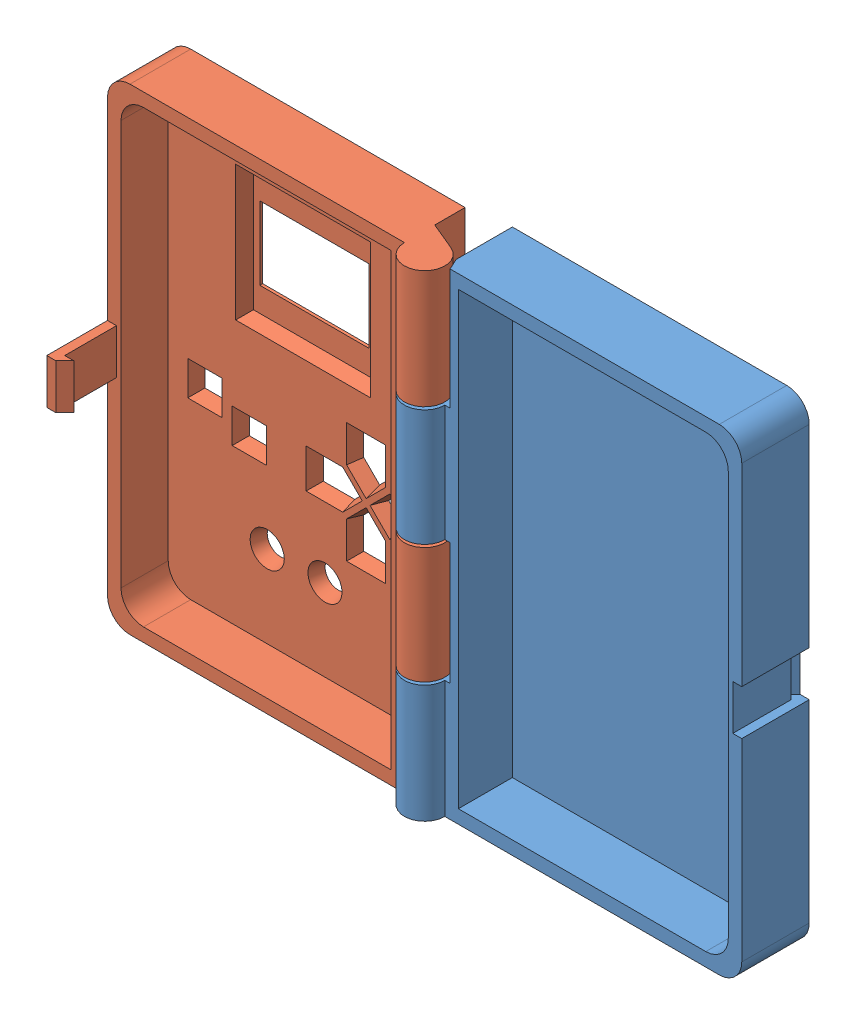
SolidWorks assembly Assemblage1.SLDASM, configuration Défaut (file format 15000). Lengths in mm.
Overall size (141 106 28.5).
2 component instances, 2 part files, 6 mates.
Components (placement in the parent):
- gameboy_coque_basse-1: gameboy_coque_basse.SLDPRT [Défaut] at (-23.9087 4.2929 95.75) size (75 106 19.5)
- gameboy_coque_haut-1: gameboy_coque_haut.SLDPRT [Défaut] at (-98.9087 4.2929 97.25) x (-1 0 0) z (0 0 1) size (75 106 27.02)
Mates (geometry in assembly coordinates):
- Coaxiale1: concentric anti-aligned: cylinder of gameboy_coque_basse-1 through (-61.4087 57.2929 110.75) axis (0 -1 0) radius 2.5; cylinder of gameboy_coque_haut-1 through (-61.4087 -48.7071 110.75) axis (0 1 0) radius 2
- Coïncidente1: coincident aligned: plane of gameboy_coque_basse-1 through (-56.9087 -48.7071 110.75) normal (0 -1 0); plane of gameboy_coque_haut-1 through (-61.4087 -48.7071 110.75) normal (0 -1 0)
- AngleLimite1: limit planar angle = 3.141593 rad anti-aligned: plane of gameboy_coque_haut-1 through (-98.9087 4.2929 110.75) normal (0 0 1); plane of gameboy_coque_basse-1 through (-23.9087 4.2929 110.75) normal (0 0 1)
- Coïncidente2: coincident anti-aligned: plane of gameboy_coque_basse-1 through (-23.9087 4.2929 98.75) normal (0 0 1); plane of IFTENDO.step-1/IFTENDO PCB.step-1 through (-23.9001 11.4929 98.75) normal (0 0 -1)
- Distance3: distance = 3 mm anti-aligned: plane of IFTENDO.step-1/IFTENDO PCB.step-1 through (3.0913 51.2929 98.75) normal (1 0 0); plane of gameboy_coque_basse-1 through (6.0913 -48.7071 110.75) normal (-1 0 0)
- Coïncidente4: coincident: plane of gameboy_coque_basse-1 through (-56.9087 54.2929 110.75) normal (0 -1 0); line of IFTENDO.step-1/IFTENDO PCB.step-1 through (0.0913 54.2929 98.75) axis (0 0 1)
